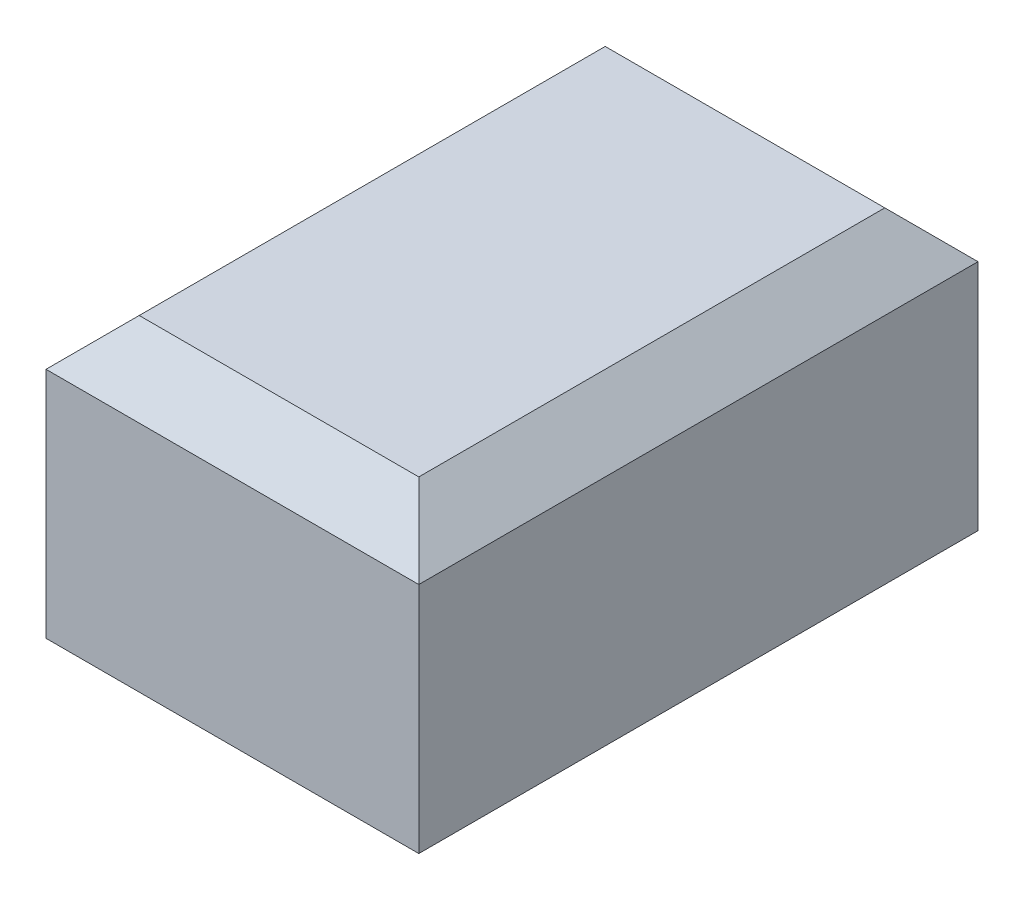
from build123d import *

# Parameters (mm, degrees)
ESQUISSE1_W      = 8
ESQUISSE1_H      = 7
EXTRUSION1_DEPTH = 12
CHANFREIN2_SIZE  = 1


with BuildPart() as part:
    # Esquisse1 → Extrusion1 (new body)
    with BuildSketch(Plane.XY):
        with Locations((4, 3.5)):
            Rectangle(ESQUISSE1_W, ESQUISSE1_H)
    extrude(amount=EXTRUSION1_DEPTH)

    # Chanfrein2
    chanfrein2_edges = [part.edges().sort_by_distance(p)[0] for p in [
        (4, 7, 12),
        (4, 7, 0),
        (4, 0, 0),
        (4, 0, 12),
        (0, 7, 6),
        (8, 7, 6),
        (8, 0, 6),
        (0, 0, 6),
    ]]
    chamfer(chanfrein2_edges, length=CHANFREIN2_SIZE)


solid = part.part
